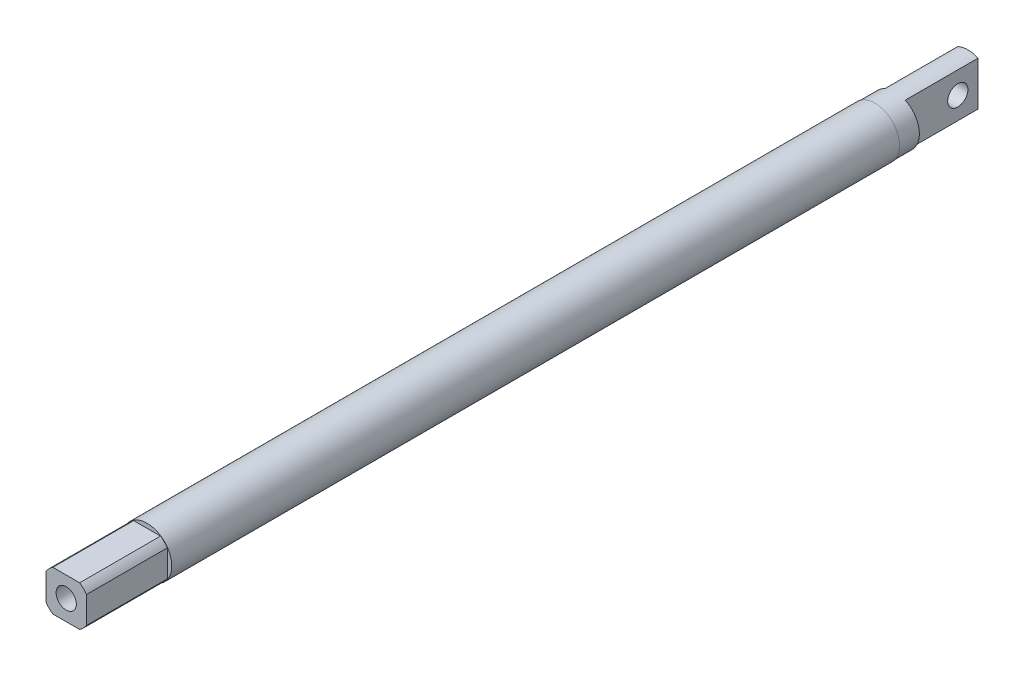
ISO-10303-21;
HEADER;
FILE_DESCRIPTION(('STEP AP214'),'2;1');
FILE_NAME('part.step','',(''),(''),'','','');
FILE_SCHEMA(('AUTOMOTIVE_DESIGN { 1 0 10303 214 1 1 1 1 }'));
ENDSEC;
DATA;
#1=APPLICATION_CONTEXT('core data for automotive mechanical design processes');
#2=APPLICATION_PROTOCOL_DEFINITION('international standard','automotive_design',2000,#1);
#3=PRODUCT_CONTEXT('',#1,'mechanical');
#4=PRODUCT('Part','Part','',(#3));
#5=PRODUCT_RELATED_PRODUCT_CATEGORY('part','',(#4));
#6=PRODUCT_DEFINITION_FORMATION('','',#4);
#7=PRODUCT_DEFINITION_CONTEXT('part definition',#1,'design');
#8=PRODUCT_DEFINITION('design','',#6,#7);
#9=PRODUCT_DEFINITION_SHAPE('','',#8);
#10=(LENGTH_UNIT() NAMED_UNIT(*) SI_UNIT(.MILLI.,.METRE.));
#11=(NAMED_UNIT(*) PLANE_ANGLE_UNIT() SI_UNIT($,.RADIAN.));
#12=(NAMED_UNIT(*) SI_UNIT($,.STERADIAN.) SOLID_ANGLE_UNIT());
#13=UNCERTAINTY_MEASURE_WITH_UNIT(LENGTH_MEASURE(1.E-05),#10,'distance_accuracy_value','');
#14=(GEOMETRIC_REPRESENTATION_CONTEXT(3) GLOBAL_UNCERTAINTY_ASSIGNED_CONTEXT((#13)) GLOBAL_UNIT_ASSIGNED_CONTEXT((#10,
#11,#12)) REPRESENTATION_CONTEXT('',''));
#15=CARTESIAN_POINT('',(0.,0.,0.));
#16=DIRECTION('',(0.,0.,1.));
#17=DIRECTION('',(1.,0.,0.));
#18=AXIS2_PLACEMENT_3D('',#15,#16,#17);
#19=CARTESIAN_POINT('',(0.,0.,-1185.70641919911));
#20=DIRECTION('',(0.,0.,-1.));
#21=DIRECTION('',(-1.,0.,0.));
#22=AXIS2_PLACEMENT_3D('',#19,#20,#21);
#23=PLANE('',#22);
#24=CARTESIAN_POINT('',(0.,0.,-1185.70641919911));
#25=DIRECTION('',(0.,0.,-1.));
#26=DIRECTION('',(-1.,0.,0.));
#27=AXIS2_PLACEMENT_3D('',#24,#25,#26);
#28=CIRCLE('',#27,7.747);
#29=CARTESIAN_POINT('',(-7.747,0.,-1185.70641919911));
#30=VERTEX_POINT('',#29);
#31=EDGE_CURVE('E167',#30,#30,#28,.T.);
#32=ORIENTED_EDGE('',*,*,#31,.F.);
#33=EDGE_LOOP('',(#32));
#34=FACE_BOUND('',#33,.T.);
#35=DIRECTION('',(0.,-1.,0.));
#36=VECTOR('',#35,1.);
#37=CARTESIAN_POINT('',(-6.35,4.21211348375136,-1185.70641919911));
#38=LINE('',#37,#36);
#39=CARTESIAN_POINT('',(-6.35,4.21211348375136,-1185.70641919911));
#40=VERTEX_POINT('',#39);
#41=CARTESIAN_POINT('',(-6.35,-4.21211348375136,-1185.70641919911));
#42=VERTEX_POINT('',#41);
#43=EDGE_CURVE('E49',#40,#42,#38,.T.);
#44=ORIENTED_EDGE('',*,*,#43,.F.);
#45=CARTESIAN_POINT('',(0.,0.,-1185.70641919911));
#46=DIRECTION('',(0.,0.,1.));
#47=DIRECTION('',(1.,0.,0.));
#48=AXIS2_PLACEMENT_3D('',#45,#46,#47);
#49=CIRCLE('',#48,7.62);
#50=CARTESIAN_POINT('',(-4.21211348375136,6.35,-1185.70641919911));
#51=VERTEX_POINT('',#50);
#52=EDGE_CURVE('E54',#51,#40,#49,.T.);
#53=ORIENTED_EDGE('',*,*,#52,.F.);
#54=DIRECTION('',(-1.,0.,0.));
#55=VECTOR('',#54,1.);
#56=CARTESIAN_POINT('',(-4.21211348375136,6.35,-1185.70641919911));
#57=LINE('',#56,#55);
#58=CARTESIAN_POINT('',(4.21211348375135,6.35,-1185.70641919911));
#59=VERTEX_POINT('',#58);
#60=EDGE_CURVE('E333',#59,#51,#57,.T.);
#61=ORIENTED_EDGE('',*,*,#60,.F.);
#62=CARTESIAN_POINT('',(0.,0.,-1185.70641919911));
#63=DIRECTION('',(0.,0.,1.));
#64=DIRECTION('',(1.,0.,0.));
#65=AXIS2_PLACEMENT_3D('',#62,#63,#64);
#66=CIRCLE('',#65,7.62);
#67=CARTESIAN_POINT('',(6.35,4.21211348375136,-1185.70641919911));
#68=VERTEX_POINT('',#67);
#69=EDGE_CURVE('E336',#68,#59,#66,.T.);
#70=ORIENTED_EDGE('',*,*,#69,.F.);
#71=DIRECTION('',(0.,1.,0.));
#72=VECTOR('',#71,1.);
#73=CARTESIAN_POINT('',(6.35,4.21211348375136,-1185.70641919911));
#74=LINE('',#73,#72);
#75=CARTESIAN_POINT('',(6.35,-4.21211348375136,-1185.70641919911));
#76=VERTEX_POINT('',#75);
#77=EDGE_CURVE('E340',#76,#68,#74,.T.);
#78=ORIENTED_EDGE('',*,*,#77,.F.);
#79=CARTESIAN_POINT('',(0.,0.,-1185.70641919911));
#80=DIRECTION('',(0.,0.,1.));
#81=DIRECTION('',(1.,0.,0.));
#82=AXIS2_PLACEMENT_3D('',#79,#80,#81);
#83=CIRCLE('',#82,7.62);
#84=CARTESIAN_POINT('',(4.21211348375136,-6.35,-1185.70641919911));
#85=VERTEX_POINT('',#84);
#86=EDGE_CURVE('E344',#85,#76,#83,.T.);
#87=ORIENTED_EDGE('',*,*,#86,.F.);
#88=DIRECTION('',(1.,0.,0.));
#89=VECTOR('',#88,1.);
#90=CARTESIAN_POINT('',(-4.21211348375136,-6.35,-1185.70641919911));
#91=LINE('',#90,#89);
#92=CARTESIAN_POINT('',(-4.21211348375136,-6.35,-1185.70641919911));
#93=VERTEX_POINT('',#92);
#94=EDGE_CURVE('E347',#93,#85,#91,.T.);
#95=ORIENTED_EDGE('',*,*,#94,.F.);
#96=CARTESIAN_POINT('',(0.,0.,-1185.70641919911));
#97=DIRECTION('',(0.,0.,1.));
#98=DIRECTION('',(1.,0.,0.));
#99=AXIS2_PLACEMENT_3D('',#96,#97,#98);
#100=CIRCLE('',#99,7.62);
#101=EDGE_CURVE('E160',#42,#93,#100,.T.);
#102=ORIENTED_EDGE('',*,*,#101,.F.);
#103=EDGE_LOOP('',(#44,#53,#61,#70,#78,#87,#95,#102));
#104=FACE_BOUND('',#103,.T.);
#105=ADVANCED_FACE('F34',(#34,#104),#23,.F.);
#106=CARTESIAN_POINT('',(0.,0.,-1443.51641919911));
#107=DIRECTION('',(0.,0.,1.));
#108=DIRECTION('',(-1.,0.,0.));
#109=AXIS2_PLACEMENT_3D('',#106,#107,#108);
#110=CYLINDRICAL_SURFACE('',#109,7.62);
#111=CARTESIAN_POINT('',(0.,0.,-1414.30641919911));
#112=DIRECTION('',(0.,0.,-1.));
#113=DIRECTION('',(-1.,0.,0.));
#114=AXIS2_PLACEMENT_3D('',#111,#112,#113);
#115=CIRCLE('',#114,7.62);
#116=CARTESIAN_POINT('',(-7.62,0.,-1414.30641919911));
#117=VERTEX_POINT('',#116);
#118=EDGE_CURVE('E166',#117,#117,#115,.T.);
#119=ORIENTED_EDGE('',*,*,#118,.T.);
#120=EDGE_LOOP('',(#119));
#121=FACE_BOUND('',#120,.T.);
#122=DIRECTION('',(0.,0.,1.));
#123=VECTOR('',#122,1.);
#124=CARTESIAN_POINT('',(-3.17500000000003,6.92703219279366,-1443.51641919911));
#125=LINE('',#124,#123);
#126=CARTESIAN_POINT('',(-3.17500000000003,6.92703219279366,-1443.51641919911));
#127=VERTEX_POINT('',#126);
#128=CARTESIAN_POINT('',(-3.17500000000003,6.92703219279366,-1420.65641919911));
#129=VERTEX_POINT('',#128);
#130=EDGE_CURVE('E179',#127,#129,#125,.T.);
#131=ORIENTED_EDGE('',*,*,#130,.T.);
#132=CARTESIAN_POINT('',(0.,0.,-1420.65641919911));
#133=DIRECTION('',(0.,0.,1.));
#134=DIRECTION('',(1.,0.,0.));
#135=AXIS2_PLACEMENT_3D('',#132,#133,#134);
#136=CIRCLE('',#135,7.62);
#137=CARTESIAN_POINT('',(-3.17500000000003,-6.92703219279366,-1420.65641919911));
#138=VERTEX_POINT('',#137);
#139=EDGE_CURVE('E185',#129,#138,#136,.T.);
#140=ORIENTED_EDGE('',*,*,#139,.T.);
#141=DIRECTION('',(0.,0.,1.));
#142=VECTOR('',#141,1.);
#143=CARTESIAN_POINT('',(-3.17500000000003,-6.92703219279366,-1443.51641919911));
#144=LINE('',#143,#142);
#145=CARTESIAN_POINT('',(-3.17500000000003,-6.92703219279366,-1443.51641919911));
#146=VERTEX_POINT('',#145);
#147=EDGE_CURVE('E188',#138,#146,#144,.F.);
#148=ORIENTED_EDGE('',*,*,#147,.T.);
#149=CARTESIAN_POINT('',(0.,0.,-1443.51641919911));
#150=DIRECTION('',(0.,0.,1.));
#151=DIRECTION('',(1.,0.,0.));
#152=AXIS2_PLACEMENT_3D('',#149,#150,#151);
#153=CIRCLE('',#152,7.62);
#154=CARTESIAN_POINT('',(3.17500000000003,-6.92703219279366,-1443.51641919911));
#155=VERTEX_POINT('',#154);
#156=EDGE_CURVE('E200',#146,#155,#153,.T.);
#157=ORIENTED_EDGE('',*,*,#156,.T.);
#158=DIRECTION('',(0.,0.,1.));
#159=VECTOR('',#158,1.);
#160=CARTESIAN_POINT('',(3.17500000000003,-6.92703219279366,-1443.51641919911));
#161=LINE('',#160,#159);
#162=CARTESIAN_POINT('',(3.17500000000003,-6.92703219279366,-1420.65641919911));
#163=VERTEX_POINT('',#162);
#164=EDGE_CURVE('E184',#163,#155,#161,.F.);
#165=ORIENTED_EDGE('',*,*,#164,.F.);
#166=CARTESIAN_POINT('',(0.,0.,-1420.65641919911));
#167=DIRECTION('',(0.,0.,-1.));
#168=DIRECTION('',(-1.,0.,0.));
#169=AXIS2_PLACEMENT_3D('',#166,#167,#168);
#170=CIRCLE('',#169,7.62);
#171=CARTESIAN_POINT('',(3.17500000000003,6.92703219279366,-1420.65641919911));
#172=VERTEX_POINT('',#171);
#173=EDGE_CURVE('E190',#172,#163,#170,.T.);
#174=ORIENTED_EDGE('',*,*,#173,.F.);
#175=DIRECTION('',(0.,0.,1.));
#176=VECTOR('',#175,1.);
#177=CARTESIAN_POINT('',(3.17500000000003,6.92703219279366,-1443.51641919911));
#178=LINE('',#177,#176);
#179=CARTESIAN_POINT('',(3.17500000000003,6.92703219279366,-1443.51641919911));
#180=VERTEX_POINT('',#179);
#181=EDGE_CURVE('E193',#180,#172,#178,.T.);
#182=ORIENTED_EDGE('',*,*,#181,.F.);
#183=EDGE_CURVE('E197',#180,#127,#153,.T.);
#184=ORIENTED_EDGE('',*,*,#183,.T.);
#185=EDGE_LOOP('',(#131,#140,#148,#157,#165,#174,#182,#184));
#186=FACE_BOUND('',#185,.T.);
#187=ADVANCED_FACE('F217',(#121,#186),#110,.T.);
#188=CARTESIAN_POINT('',(0.,0.,-1443.51641919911));
#189=DIRECTION('',(0.,0.,-1.));
#190=DIRECTION('',(1.,0.,0.));
#191=AXIS2_PLACEMENT_3D('',#188,#189,#190);
#192=PLANE('',#191);
#193=ORIENTED_EDGE('',*,*,#183,.F.);
#194=DIRECTION('',(0.,-1.,0.));
#195=VECTOR('',#194,1.);
#196=CARTESIAN_POINT('',(3.17500000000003,0.,-1443.51641919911));
#197=LINE('',#196,#195);
#198=EDGE_CURVE('E195',#180,#155,#197,.T.);
#199=ORIENTED_EDGE('',*,*,#198,.T.);
#200=ORIENTED_EDGE('',*,*,#156,.F.);
#201=DIRECTION('',(0.,-1.,0.));
#202=VECTOR('',#201,1.);
#203=CARTESIAN_POINT('',(-3.17500000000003,0.,-1443.51641919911));
#204=LINE('',#203,#202);
#205=EDGE_CURVE('E183',#127,#146,#204,.T.);
#206=ORIENTED_EDGE('',*,*,#205,.F.);
#207=EDGE_LOOP('',(#193,#199,#200,#206));
#208=FACE_BOUND('',#207,.T.);
#209=ADVANCED_FACE('F222',(#208),#192,.T.);
#210=CARTESIAN_POINT('',(3.17500000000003,-8.382,-1420.65641919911));
#211=DIRECTION('',(0.,0.,1.));
#212=DIRECTION('',(-1.,0.,0.));
#213=AXIS2_PLACEMENT_3D('',#210,#211,#212);
#214=PLANE('',#213);
#215=DIRECTION('',(0.,1.,0.));
#216=VECTOR('',#215,1.);
#217=CARTESIAN_POINT('',(3.17500000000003,-8.382,-1420.65641919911));
#218=LINE('',#217,#216);
#219=EDGE_CURVE('E194',#163,#172,#218,.T.);
#220=ORIENTED_EDGE('',*,*,#219,.T.);
#221=ORIENTED_EDGE('',*,*,#173,.T.);
#222=EDGE_LOOP('',(#220,#221));
#223=FACE_BOUND('',#222,.T.);
#224=ADVANCED_FACE('F229',(#223),#214,.F.);
#225=CARTESIAN_POINT('',(3.17500000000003,-8.382,-1420.65641919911));
#226=DIRECTION('',(-1.,0.,0.));
#227=DIRECTION('',(0.,0.,-1.));
#228=AXIS2_PLACEMENT_3D('',#225,#226,#227);
#229=PLANE('',#228);
#230=CARTESIAN_POINT('',(3.17500000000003,0.,-1437.16641919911));
#231=DIRECTION('',(1.,0.,0.));
#232=DIRECTION('',(0.,0.,-1.));
#233=AXIS2_PLACEMENT_3D('',#230,#231,#232);
#234=CIRCLE('',#233,3.17499999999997);
#235=CARTESIAN_POINT('',(3.17500000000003,0.,-1440.34141919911));
#236=VERTEX_POINT('',#235);
#237=EDGE_CURVE('E11',#236,#236,#234,.T.);
#238=ORIENTED_EDGE('',*,*,#237,.F.);
#239=EDGE_LOOP('',(#238));
#240=FACE_BOUND('',#239,.T.);
#241=ORIENTED_EDGE('',*,*,#198,.F.);
#242=ORIENTED_EDGE('',*,*,#181,.T.);
#243=ORIENTED_EDGE('',*,*,#219,.F.);
#244=ORIENTED_EDGE('',*,*,#164,.T.);
#245=EDGE_LOOP('',(#241,#242,#243,#244));
#246=FACE_BOUND('',#245,.T.);
#247=ADVANCED_FACE('F227',(#240,#246),#229,.F.);
#248=CARTESIAN_POINT('',(-3.17500000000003,-8.382,-1420.65641919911));
#249=DIRECTION('',(0.,0.,-1.));
#250=DIRECTION('',(1.,0.,0.));
#251=AXIS2_PLACEMENT_3D('',#248,#249,#250);
#252=PLANE('',#251);
#253=ORIENTED_EDGE('',*,*,#139,.F.);
#254=DIRECTION('',(0.,1.,0.));
#255=VECTOR('',#254,1.);
#256=CARTESIAN_POINT('',(-3.17500000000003,-8.382,-1420.65641919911));
#257=LINE('',#256,#255);
#258=EDGE_CURVE('E42',#138,#129,#257,.T.);
#259=ORIENTED_EDGE('',*,*,#258,.F.);
#260=EDGE_LOOP('',(#253,#259));
#261=FACE_BOUND('',#260,.T.);
#262=ADVANCED_FACE('F215',(#261),#252,.T.);
#263=CARTESIAN_POINT('',(-3.17500000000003,-8.382,-1420.65641919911));
#264=DIRECTION('',(-1.,0.,0.));
#265=DIRECTION('',(0.,0.,-1.));
#266=AXIS2_PLACEMENT_3D('',#263,#264,#265);
#267=PLANE('',#266);
#268=CARTESIAN_POINT('',(-3.17500000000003,0.,-1437.16641919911));
#269=DIRECTION('',(1.,0.,0.));
#270=DIRECTION('',(0.,0.,-1.));
#271=AXIS2_PLACEMENT_3D('',#268,#269,#270);
#272=CIRCLE('',#271,3.17499999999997);
#273=CARTESIAN_POINT('',(-3.17500000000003,0.,-1440.34141919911));
#274=VERTEX_POINT('',#273);
#275=EDGE_CURVE('E180',#274,#274,#272,.T.);
#276=ORIENTED_EDGE('',*,*,#275,.T.);
#277=EDGE_LOOP('',(#276));
#278=FACE_BOUND('',#277,.T.);
#279=ORIENTED_EDGE('',*,*,#130,.F.);
#280=ORIENTED_EDGE('',*,*,#205,.T.);
#281=ORIENTED_EDGE('',*,*,#147,.F.);
#282=ORIENTED_EDGE('',*,*,#258,.T.);
#283=EDGE_LOOP('',(#279,#280,#281,#282));
#284=FACE_BOUND('',#283,.T.);
#285=ADVANCED_FACE('F213',(#278,#284),#267,.T.);
#286=CARTESIAN_POINT('',(-8.382,0.,-1437.16641919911));
#287=DIRECTION('',(1.,0.,0.));
#288=DIRECTION('',(0.,0.,1.));
#289=AXIS2_PLACEMENT_3D('',#286,#287,#288);
#290=CYLINDRICAL_SURFACE('',#289,3.17499999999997);
#291=ORIENTED_EDGE('',*,*,#275,.F.);
#292=EDGE_LOOP('',(#291));
#293=FACE_BOUND('',#292,.T.);
#294=ORIENTED_EDGE('',*,*,#237,.T.);
#295=EDGE_LOOP('',(#294));
#296=FACE_BOUND('',#295,.T.);
#297=ADVANCED_FACE('F263',(#293,#296),#290,.F.);
#298=CARTESIAN_POINT('',(0.,0.,-1414.30641919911));
#299=DIRECTION('',(0.,0.,-1.));
#300=DIRECTION('',(1.,0.,0.));
#301=AXIS2_PLACEMENT_3D('',#298,#299,#300);
#302=PLANE('',#301);
#303=CARTESIAN_POINT('',(0.,0.,-1414.30641919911));
#304=DIRECTION('',(0.,0.,-1.));
#305=DIRECTION('',(-1.,0.,0.));
#306=AXIS2_PLACEMENT_3D('',#303,#304,#305);
#307=CIRCLE('',#306,7.747);
#308=CARTESIAN_POINT('',(-7.747,0.,-1414.30641919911));
#309=VERTEX_POINT('',#308);
#310=EDGE_CURVE('E163',#309,#309,#307,.T.);
#311=ORIENTED_EDGE('',*,*,#310,.T.);
#312=EDGE_LOOP('',(#311));
#313=FACE_BOUND('',#312,.T.);
#314=ORIENTED_EDGE('',*,*,#118,.F.);
#315=EDGE_LOOP('',(#314));
#316=FACE_BOUND('',#315,.T.);
#317=ADVANCED_FACE('F255',(#313,#316),#302,.T.);
#318=CARTESIAN_POINT('',(0.,0.,-1436.21824413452));
#319=DIRECTION('',(0.,0.,1.));
#320=DIRECTION('',(1.,0.,0.));
#321=AXIS2_PLACEMENT_3D('',#318,#319,#320);
#322=CYLINDRICAL_SURFACE('',#321,7.747);
#323=ORIENTED_EDGE('',*,*,#31,.T.);
#324=EDGE_LOOP('',(#323));
#325=FACE_BOUND('',#324,.T.);
#326=ORIENTED_EDGE('',*,*,#310,.F.);
#327=EDGE_LOOP('',(#326));
#328=FACE_BOUND('',#327,.T.);
#329=ADVANCED_FACE('F253',(#325,#328),#322,.T.);
#330=CARTESIAN_POINT('',(0.,0.,-1160.30641919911));
#331=DIRECTION('',(0.,0.,-1.));
#332=DIRECTION('',(1.,0.,0.));
#333=AXIS2_PLACEMENT_3D('',#330,#331,#332);
#334=PLANE('',#333);
#335=CARTESIAN_POINT('',(0.,0.,-1160.30641919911));
#336=DIRECTION('',(0.,0.,1.));
#337=DIRECTION('',(1.,0.,0.));
#338=AXIS2_PLACEMENT_3D('',#335,#336,#337);
#339=CIRCLE('',#338,7.62);
#340=CARTESIAN_POINT('',(-6.35,-4.21211348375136,-1160.30641919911));
#341=VERTEX_POINT('',#340);
#342=CARTESIAN_POINT('',(-4.21211348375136,-6.35,-1160.30641919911));
#343=VERTEX_POINT('',#342);
#344=EDGE_CURVE('E318',#341,#343,#339,.T.);
#345=ORIENTED_EDGE('',*,*,#344,.T.);
#346=DIRECTION('',(1.,0.,0.));
#347=VECTOR('',#346,1.);
#348=CARTESIAN_POINT('',(-4.21211348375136,-6.35,-1160.30641919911));
#349=LINE('',#348,#347);
#350=CARTESIAN_POINT('',(4.21211348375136,-6.35,-1160.30641919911));
#351=VERTEX_POINT('',#350);
#352=EDGE_CURVE('E324',#343,#351,#349,.T.);
#353=ORIENTED_EDGE('',*,*,#352,.T.);
#354=CARTESIAN_POINT('',(0.,0.,-1160.30641919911));
#355=DIRECTION('',(0.,0.,1.));
#356=DIRECTION('',(1.,0.,0.));
#357=AXIS2_PLACEMENT_3D('',#354,#355,#356);
#358=CIRCLE('',#357,7.62);
#359=CARTESIAN_POINT('',(6.35,-4.21211348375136,-1160.30641919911));
#360=VERTEX_POINT('',#359);
#361=EDGE_CURVE('E326',#351,#360,#358,.T.);
#362=ORIENTED_EDGE('',*,*,#361,.T.);
#363=DIRECTION('',(0.,1.,0.));
#364=VECTOR('',#363,1.);
#365=CARTESIAN_POINT('',(6.35,4.21211348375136,-1160.30641919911));
#366=LINE('',#365,#364);
#367=CARTESIAN_POINT('',(6.35,4.21211348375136,-1160.30641919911));
#368=VERTEX_POINT('',#367);
#369=EDGE_CURVE('E371',#360,#368,#366,.T.);
#370=ORIENTED_EDGE('',*,*,#369,.T.);
#371=CARTESIAN_POINT('',(0.,0.,-1160.30641919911));
#372=DIRECTION('',(0.,0.,1.));
#373=DIRECTION('',(1.,0.,0.));
#374=AXIS2_PLACEMENT_3D('',#371,#372,#373);
#375=CIRCLE('',#374,7.62);
#376=CARTESIAN_POINT('',(4.21211348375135,6.35,-1160.30641919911));
#377=VERTEX_POINT('',#376);
#378=EDGE_CURVE('E368',#368,#377,#375,.T.);
#379=ORIENTED_EDGE('',*,*,#378,.T.);
#380=DIRECTION('',(-1.,0.,0.));
#381=VECTOR('',#380,1.);
#382=CARTESIAN_POINT('',(-4.21211348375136,6.35,-1160.30641919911));
#383=LINE('',#382,#381);
#384=CARTESIAN_POINT('',(-4.21211348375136,6.35,-1160.30641919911));
#385=VERTEX_POINT('',#384);
#386=EDGE_CURVE('E365',#377,#385,#383,.T.);
#387=ORIENTED_EDGE('',*,*,#386,.T.);
#388=CARTESIAN_POINT('',(0.,0.,-1160.30641919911));
#389=DIRECTION('',(0.,0.,1.));
#390=DIRECTION('',(1.,0.,0.));
#391=AXIS2_PLACEMENT_3D('',#388,#389,#390);
#392=CIRCLE('',#391,7.62);
#393=CARTESIAN_POINT('',(-6.35,4.21211348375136,-1160.30641919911));
#394=VERTEX_POINT('',#393);
#395=EDGE_CURVE('E156',#385,#394,#392,.T.);
#396=ORIENTED_EDGE('',*,*,#395,.T.);
#397=DIRECTION('',(0.,-1.,0.));
#398=VECTOR('',#397,1.);
#399=CARTESIAN_POINT('',(-6.35,4.21211348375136,-1160.30641919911));
#400=LINE('',#399,#398);
#401=EDGE_CURVE('E154',#394,#341,#400,.T.);
#402=ORIENTED_EDGE('',*,*,#401,.T.);
#403=EDGE_LOOP('',(#345,#353,#362,#370,#379,#387,#396,#402));
#404=FACE_BOUND('',#403,.T.);
#405=CARTESIAN_POINT('',(0.,0.,-1160.30641919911));
#406=DIRECTION('',(0.,0.,1.));
#407=DIRECTION('',(1.,0.,0.));
#408=AXIS2_PLACEMENT_3D('',#405,#406,#407);
#409=CIRCLE('',#408,3.175);
#410=CARTESIAN_POINT('',(3.175,0.,-1160.30641919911));
#411=VERTEX_POINT('',#410);
#412=CARTESIAN_POINT('',(0.,3.175,-1160.30641919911));
#413=VERTEX_POINT('',#412);
#414=EDGE_CURVE('E134',#411,#413,#409,.T.);
#415=ORIENTED_EDGE('',*,*,#414,.F.);
#416=EDGE_CURVE('E146',#413,#411,#409,.T.);
#417=ORIENTED_EDGE('',*,*,#416,.F.);
#418=EDGE_LOOP('',(#415,#417));
#419=FACE_BOUND('',#418,.T.);
#420=ADVANCED_FACE('F153',(#404,#419),#334,.F.);
#421=CARTESIAN_POINT('',(0.,0.,-1185.70641919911));
#422=DIRECTION('',(0.,0.,1.));
#423=DIRECTION('',(-1.,0.,0.));
#424=AXIS2_PLACEMENT_3D('',#421,#422,#423);
#425=CYLINDRICAL_SURFACE('',#424,3.175);
#426=ORIENTED_EDGE('',*,*,#416,.T.);
#427=DIRECTION('',(0.,0.,1.));
#428=VECTOR('',#427,1.);
#429=CARTESIAN_POINT('',(3.175,0.,-1185.70641919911));
#430=LINE('',#429,#428);
#431=CARTESIAN_POINT('',(3.175,0.,-1185.70641919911));
#432=VERTEX_POINT('',#431);
#433=EDGE_CURVE('E140',#432,#411,#430,.T.);
#434=ORIENTED_EDGE('',*,*,#433,.F.);
#435=CARTESIAN_POINT('',(0.,0.,-1185.70641919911));
#436=DIRECTION('',(0.,0.,1.));
#437=DIRECTION('',(1.,0.,0.));
#438=AXIS2_PLACEMENT_3D('',#435,#436,#437);
#439=CIRCLE('',#438,3.175);
#440=CARTESIAN_POINT('',(0.,3.175,-1185.70641919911));
#441=VERTEX_POINT('',#440);
#442=EDGE_CURVE('E150',#441,#432,#439,.T.);
#443=ORIENTED_EDGE('',*,*,#442,.F.);
#444=DIRECTION('',(0.,0.,1.));
#445=VECTOR('',#444,1.);
#446=CARTESIAN_POINT('',(0.,3.175,-1185.70641919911));
#447=LINE('',#446,#445);
#448=EDGE_CURVE('E137',#413,#441,#447,.F.);
#449=ORIENTED_EDGE('',*,*,#448,.F.);
#450=EDGE_LOOP('',(#426,#434,#443,#449));
#451=FACE_BOUND('',#450,.T.);
#452=ADVANCED_FACE('F148',(#451),#425,.F.);
#453=ORIENTED_EDGE('',*,*,#448,.T.);
#454=EDGE_CURVE('E144',#432,#441,#439,.T.);
#455=ORIENTED_EDGE('',*,*,#454,.F.);
#456=ORIENTED_EDGE('',*,*,#433,.T.);
#457=ORIENTED_EDGE('',*,*,#414,.T.);
#458=EDGE_LOOP('',(#453,#455,#456,#457));
#459=FACE_BOUND('',#458,.T.);
#460=ADVANCED_FACE('F136',(#459),#425,.F.);
#461=CARTESIAN_POINT('',(0.,0.,-1185.70641919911));
#462=DIRECTION('',(0.,0.,-1.));
#463=DIRECTION('',(1.,0.,0.));
#464=AXIS2_PLACEMENT_3D('',#461,#462,#463);
#465=PLANE('',#464);
#466=CARTESIAN_POINT('',(0.,0.,-1185.70641919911));
#467=DIRECTION('',(0.,0.,-1.));
#468=DIRECTION('',(-1.,0.,0.));
#469=AXIS2_PLACEMENT_3D('',#466,#467,#468);
#470=CIRCLE('',#469,6.223);
#471=CARTESIAN_POINT('',(-6.223,0.,-1185.70641919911));
#472=VERTEX_POINT('',#471);
#473=EDGE_CURVE('E168',#472,#472,#470,.T.);
#474=ORIENTED_EDGE('',*,*,#473,.T.);
#475=EDGE_LOOP('',(#474));
#476=FACE_BOUND('',#475,.T.);
#477=ORIENTED_EDGE('',*,*,#454,.T.);
#478=ORIENTED_EDGE('',*,*,#442,.T.);
#479=EDGE_LOOP('',(#477,#478));
#480=FACE_BOUND('',#479,.T.);
#481=ADVANCED_FACE('F276',(#476,#480),#465,.T.);
#482=CARTESIAN_POINT('',(-6.35,4.21211348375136,-1185.70641919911));
#483=DIRECTION('',(1.,0.,0.));
#484=DIRECTION('',(0.,0.,1.));
#485=AXIS2_PLACEMENT_3D('',#482,#483,#484);
#486=PLANE('',#485);
#487=ORIENTED_EDGE('',*,*,#401,.F.);
#488=DIRECTION('',(0.,0.,1.));
#489=VECTOR('',#488,1.);
#490=CARTESIAN_POINT('',(-6.35,4.21211348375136,-1185.70641919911));
#491=LINE('',#490,#489);
#492=EDGE_CURVE('E332',#40,#394,#491,.T.);
#493=ORIENTED_EDGE('',*,*,#492,.F.);
#494=ORIENTED_EDGE('',*,*,#43,.T.);
#495=DIRECTION('',(0.,0.,1.));
#496=VECTOR('',#495,1.);
#497=CARTESIAN_POINT('',(-6.35,-4.21211348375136,-1185.70641919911));
#498=LINE('',#497,#496);
#499=EDGE_CURVE('E320',#42,#341,#498,.T.);
#500=ORIENTED_EDGE('',*,*,#499,.T.);
#501=EDGE_LOOP('',(#487,#493,#494,#500));
#502=FACE_BOUND('',#501,.T.);
#503=ADVANCED_FACE('F278',(#502),#486,.F.);
#504=CARTESIAN_POINT('',(0.,0.,-1185.70641919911));
#505=DIRECTION('',(0.,0.,1.));
#506=DIRECTION('',(-1.,0.,0.));
#507=AXIS2_PLACEMENT_3D('',#504,#505,#506);
#508=CYLINDRICAL_SURFACE('',#507,7.62);
#509=ORIENTED_EDGE('',*,*,#395,.F.);
#510=DIRECTION('',(0.,0.,1.));
#511=VECTOR('',#510,1.);
#512=CARTESIAN_POINT('',(-4.21211348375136,6.35,-1185.70641919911));
#513=LINE('',#512,#511);
#514=EDGE_CURVE('E335',#51,#385,#513,.T.);
#515=ORIENTED_EDGE('',*,*,#514,.F.);
#516=ORIENTED_EDGE('',*,*,#52,.T.);
#517=ORIENTED_EDGE('',*,*,#492,.T.);
#518=EDGE_LOOP('',(#509,#515,#516,#517));
#519=FACE_BOUND('',#518,.T.);
#520=ADVANCED_FACE('F283',(#519),#508,.T.);
#521=CARTESIAN_POINT('',(-4.21211348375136,6.35,-1185.70641919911));
#522=DIRECTION('',(0.,-1.,0.));
#523=DIRECTION('',(1.,0.,0.));
#524=AXIS2_PLACEMENT_3D('',#521,#522,#523);
#525=PLANE('',#524);
#526=ORIENTED_EDGE('',*,*,#386,.F.);
#527=DIRECTION('',(0.,0.,1.));
#528=VECTOR('',#527,1.);
#529=CARTESIAN_POINT('',(4.21211348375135,6.35,-1185.70641919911));
#530=LINE('',#529,#528);
#531=EDGE_CURVE('E339',#59,#377,#530,.T.);
#532=ORIENTED_EDGE('',*,*,#531,.F.);
#533=ORIENTED_EDGE('',*,*,#60,.T.);
#534=ORIENTED_EDGE('',*,*,#514,.T.);
#535=EDGE_LOOP('',(#526,#532,#533,#534));
#536=FACE_BOUND('',#535,.T.);
#537=ADVANCED_FACE('F287',(#536),#525,.F.);
#538=CARTESIAN_POINT('',(0.,0.,-1185.70641919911));
#539=DIRECTION('',(0.,0.,1.));
#540=DIRECTION('',(-1.,0.,0.));
#541=AXIS2_PLACEMENT_3D('',#538,#539,#540);
#542=CYLINDRICAL_SURFACE('',#541,7.62);
#543=ORIENTED_EDGE('',*,*,#378,.F.);
#544=DIRECTION('',(0.,0.,1.));
#545=VECTOR('',#544,1.);
#546=CARTESIAN_POINT('',(6.35,4.21211348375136,-1185.70641919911));
#547=LINE('',#546,#545);
#548=EDGE_CURVE('E343',#68,#368,#547,.T.);
#549=ORIENTED_EDGE('',*,*,#548,.F.);
#550=ORIENTED_EDGE('',*,*,#69,.T.);
#551=ORIENTED_EDGE('',*,*,#531,.T.);
#552=EDGE_LOOP('',(#543,#549,#550,#551));
#553=FACE_BOUND('',#552,.T.);
#554=ADVANCED_FACE('F291',(#553),#542,.T.);
#555=CARTESIAN_POINT('',(6.35,4.21211348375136,-1185.70641919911));
#556=DIRECTION('',(-1.,0.,0.));
#557=DIRECTION('',(0.,-1.,0.));
#558=AXIS2_PLACEMENT_3D('',#555,#556,#557);
#559=PLANE('',#558);
#560=ORIENTED_EDGE('',*,*,#369,.F.);
#561=DIRECTION('',(0.,0.,1.));
#562=VECTOR('',#561,1.);
#563=CARTESIAN_POINT('',(6.35,-4.21211348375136,-1185.70641919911));
#564=LINE('',#563,#562);
#565=EDGE_CURVE('E346',#76,#360,#564,.T.);
#566=ORIENTED_EDGE('',*,*,#565,.F.);
#567=ORIENTED_EDGE('',*,*,#77,.T.);
#568=ORIENTED_EDGE('',*,*,#548,.T.);
#569=EDGE_LOOP('',(#560,#566,#567,#568));
#570=FACE_BOUND('',#569,.T.);
#571=ADVANCED_FACE('F295',(#570),#559,.F.);
#572=CARTESIAN_POINT('',(0.,0.,-1185.70641919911));
#573=DIRECTION('',(0.,0.,1.));
#574=DIRECTION('',(-1.,0.,0.));
#575=AXIS2_PLACEMENT_3D('',#572,#573,#574);
#576=CYLINDRICAL_SURFACE('',#575,7.62);
#577=ORIENTED_EDGE('',*,*,#361,.F.);
#578=DIRECTION('',(0.,0.,1.));
#579=VECTOR('',#578,1.);
#580=CARTESIAN_POINT('',(4.21211348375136,-6.35,-1185.70641919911));
#581=LINE('',#580,#579);
#582=EDGE_CURVE('E349',#85,#351,#581,.T.);
#583=ORIENTED_EDGE('',*,*,#582,.F.);
#584=ORIENTED_EDGE('',*,*,#86,.T.);
#585=ORIENTED_EDGE('',*,*,#565,.T.);
#586=EDGE_LOOP('',(#577,#583,#584,#585));
#587=FACE_BOUND('',#586,.T.);
#588=ADVANCED_FACE('F299',(#587),#576,.T.);
#589=CARTESIAN_POINT('',(-4.21211348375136,-6.35,-1185.70641919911));
#590=DIRECTION('',(0.,1.,0.));
#591=DIRECTION('',(-1.,0.,0.));
#592=AXIS2_PLACEMENT_3D('',#589,#590,#591);
#593=PLANE('',#592);
#594=ORIENTED_EDGE('',*,*,#352,.F.);
#595=DIRECTION('',(0.,0.,1.));
#596=VECTOR('',#595,1.);
#597=CARTESIAN_POINT('',(-4.21211348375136,-6.35,-1185.70641919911));
#598=LINE('',#597,#596);
#599=EDGE_CURVE('E176',#93,#343,#598,.T.);
#600=ORIENTED_EDGE('',*,*,#599,.F.);
#601=ORIENTED_EDGE('',*,*,#94,.T.);
#602=ORIENTED_EDGE('',*,*,#582,.T.);
#603=EDGE_LOOP('',(#594,#600,#601,#602));
#604=FACE_BOUND('',#603,.T.);
#605=ADVANCED_FACE('F303',(#604),#593,.F.);
#606=CARTESIAN_POINT('',(0.,0.,-1185.70641919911));
#607=DIRECTION('',(0.,0.,1.));
#608=DIRECTION('',(-1.,0.,0.));
#609=AXIS2_PLACEMENT_3D('',#606,#607,#608);
#610=CYLINDRICAL_SURFACE('',#609,7.62);
#611=ORIENTED_EDGE('',*,*,#344,.F.);
#612=ORIENTED_EDGE('',*,*,#499,.F.);
#613=ORIENTED_EDGE('',*,*,#101,.T.);
#614=ORIENTED_EDGE('',*,*,#599,.T.);
#615=EDGE_LOOP('',(#611,#612,#613,#614));
#616=FACE_BOUND('',#615,.T.);
#617=ADVANCED_FACE('F307',(#616),#610,.T.);
#618=CARTESIAN_POINT('',(0.,0.,-1414.30641919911));
#619=DIRECTION('',(0.,0.,-1.));
#620=DIRECTION('',(1.,0.,0.));
#621=AXIS2_PLACEMENT_3D('',#618,#619,#620);
#622=PLANE('',#621);
#623=CARTESIAN_POINT('',(0.,0.,-1414.30641919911));
#624=DIRECTION('',(0.,0.,-1.));
#625=DIRECTION('',(-1.,0.,0.));
#626=AXIS2_PLACEMENT_3D('',#623,#624,#625);
#627=CIRCLE('',#626,6.223);
#628=CARTESIAN_POINT('',(-6.223,0.,-1414.30641919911));
#629=VERTEX_POINT('',#628);
#630=EDGE_CURVE('E171',#629,#629,#627,.T.);
#631=ORIENTED_EDGE('',*,*,#630,.F.);
#632=EDGE_LOOP('',(#631));
#633=FACE_BOUND('',#632,.T.);
#634=ADVANCED_FACE('F36',(#633),#622,.F.);
#635=CARTESIAN_POINT('',(0.,0.,-1436.21824413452));
#636=DIRECTION('',(0.,0.,1.));
#637=DIRECTION('',(1.,0.,0.));
#638=AXIS2_PLACEMENT_3D('',#635,#636,#637);
#639=CYLINDRICAL_SURFACE('',#638,6.223);
#640=ORIENTED_EDGE('',*,*,#473,.F.);
#641=EDGE_LOOP('',(#640));
#642=FACE_BOUND('',#641,.T.);
#643=ORIENTED_EDGE('',*,*,#630,.T.);
#644=EDGE_LOOP('',(#643));
#645=FACE_BOUND('',#644,.T.);
#646=ADVANCED_FACE('F251',(#642,#645),#639,.F.);
#647=CLOSED_SHELL('',(#105,#187,#209,#224,#247,#262,#285,#297,#317,#329,#420,#452,#460,#481,
#503,#520,#537,#554,#571,#588,#605,#617,#634,#646));
#648=MANIFOLD_SOLID_BREP('B2',#647);
#649=ADVANCED_BREP_SHAPE_REPRESENTATION('',(#18,#648),#14);
#650=SHAPE_DEFINITION_REPRESENTATION(#9,#649);
ENDSEC;
END-ISO-10303-21;
